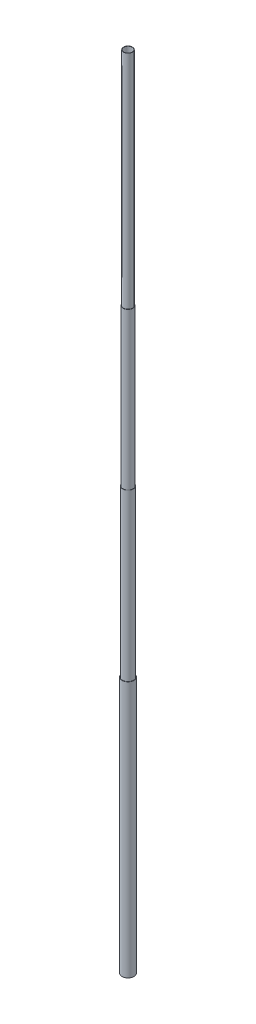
from build123d import *

# Parameters (mm, degrees)
SKETCH1_W   = 1.1
SKETCH1_H   = 1100
SKETCH1_W_2 = 1
SKETCH1_H_2 = 1010
SKETCH1_H_3 = 970
SKETCH1_H_4 = 1000


with BuildPart() as part:
    # Sketch1 → Revolve1 (revolve)
    with BuildSketch(Plane.XY, mode=Mode.PRIVATE) as revolve1_sk:
        with Locations((24.95, 550)):
            Rectangle(SKETCH1_W, SKETCH1_H)
        with Locations((22.5, 1305)):
            Rectangle(SKETCH1_W_2, SKETCH1_H_2)
        with Locations((20.5, 1995)):
            Rectangle(SKETCH1_W_2, SKETCH1_H_3)
        with Locations((18.5, 2930)):
            Rectangle(SKETCH1_W_2, SKETCH1_H_4)
    revolve(revolve1_sk.sketch.rotate(Axis((0, 435.75, 0), (0, -1, 0)), 90), axis=Axis((0, 435.75, 0), (0, -1, 0)))


solid = part.part
